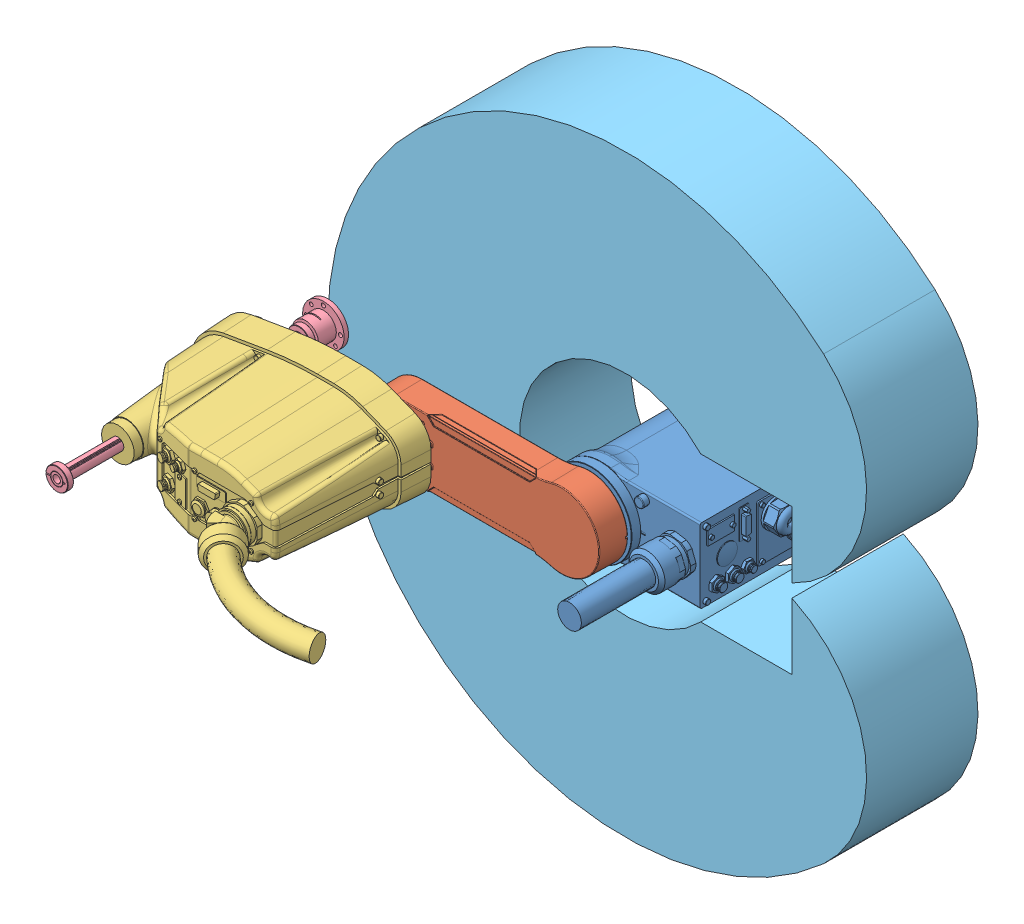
SolidWorks assembly GBT-S3A-400仿真模型.SLDASM, configuration 默认 (file format 13000). Lengths in mm.
Overall size (795.98 800 558.75).
5 component instances, 5 part files, 0 mates.
Components (placement in the parent):
- GBT-S3A-100.00-1: GBT-S3A-100.00.SLDPRT [默认] at origin size (215.75 140 309)
- GBT-S3A-200.00-1: GBT-S3A-200.00.SLDPRT [默认] at (-225 0 214.9) x (1 0 0) z (0 0 -1) size (321.95 102.96 53)
- GBT-S3A-300.00-1: GBT-S3A-300.00.SLDPRT [默认] at (-225 0 226.9) size (447.2 135.62 347.98)
- GBT-S3A-400.00-1: GBT-S3A-400.00.SLDPRT [默认] at (-400 0 144.5) x (0 1 0) z (0 0 1) size (56 56 365)
- GBT-S3A-运动范围-1: GBT-S3A-运动范围.SLDPRT [默认] at (0 0 129.5) x (1 0 0) z (0 1 0) size (725.55 150 800)
